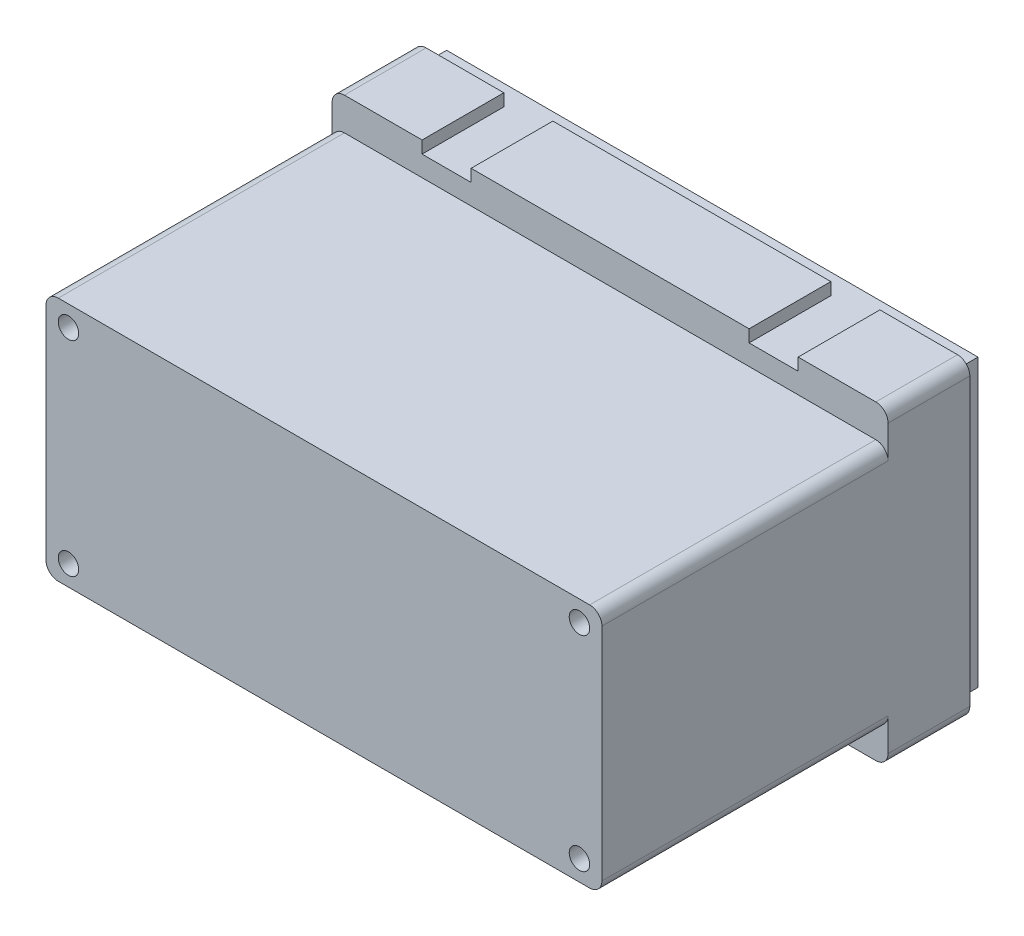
ISO-10303-21;
HEADER;
FILE_DESCRIPTION(('STEP AP214'),'2;1');
FILE_NAME('part.step','',(''),(''),'','','');
FILE_SCHEMA(('AUTOMOTIVE_DESIGN { 1 0 10303 214 1 1 1 1 }'));
ENDSEC;
DATA;
#1=APPLICATION_CONTEXT('core data for automotive mechanical design processes');
#2=APPLICATION_PROTOCOL_DEFINITION('international standard','automotive_design',2000,#1);
#3=PRODUCT_CONTEXT('',#1,'mechanical');
#4=PRODUCT('Part','Part','',(#3));
#5=PRODUCT_RELATED_PRODUCT_CATEGORY('part','',(#4));
#6=PRODUCT_DEFINITION_FORMATION('','',#4);
#7=PRODUCT_DEFINITION_CONTEXT('part definition',#1,'design');
#8=PRODUCT_DEFINITION('design','',#6,#7);
#9=PRODUCT_DEFINITION_SHAPE('','',#8);
#10=(LENGTH_UNIT() NAMED_UNIT(*) SI_UNIT(.MILLI.,.METRE.));
#11=(NAMED_UNIT(*) PLANE_ANGLE_UNIT() SI_UNIT($,.RADIAN.));
#12=(NAMED_UNIT(*) SI_UNIT($,.STERADIAN.) SOLID_ANGLE_UNIT());
#13=UNCERTAINTY_MEASURE_WITH_UNIT(LENGTH_MEASURE(1.E-05),#10,'distance_accuracy_value','');
#14=(GEOMETRIC_REPRESENTATION_CONTEXT(3) GLOBAL_UNCERTAINTY_ASSIGNED_CONTEXT((#13)) GLOBAL_UNIT_ASSIGNED_CONTEXT((#10,
#11,#12)) REPRESENTATION_CONTEXT('',''));
#15=CARTESIAN_POINT('',(0.,0.,0.));
#16=DIRECTION('',(0.,0.,1.));
#17=DIRECTION('',(1.,0.,0.));
#18=AXIS2_PLACEMENT_3D('',#15,#16,#17);
#19=CARTESIAN_POINT('',(65.,34.9999999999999,20.));
#20=DIRECTION('',(0.,0.,1.));
#21=DIRECTION('',(1.,0.,0.));
#22=AXIS2_PLACEMENT_3D('',#19,#20,#21);
#23=PLANE('',#22);
#24=CARTESIAN_POINT('',(65.,-26.9999999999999,20.));
#25=DIRECTION('',(0.,0.,1.));
#26=DIRECTION('',(-1.,0.,0.));
#27=AXIS2_PLACEMENT_3D('',#24,#25,#26);
#28=CIRCLE('',#27,3.);
#29=CARTESIAN_POINT('',(65.,-30.,20.));
#30=VERTEX_POINT('',#29);
#31=CARTESIAN_POINT('',(68.,-26.9999999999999,20.));
#32=VERTEX_POINT('',#31);
#33=EDGE_CURVE('E365',#30,#32,#28,.T.);
#34=ORIENTED_EDGE('',*,*,#33,.F.);
#35=DIRECTION('',(1.,0.,0.));
#36=VECTOR('',#35,1.);
#37=CARTESIAN_POINT('',(-65.,-30.,20.));
#38=LINE('',#37,#36);
#39=CARTESIAN_POINT('',(-65.,-30.,20.));
#40=VERTEX_POINT('',#39);
#41=EDGE_CURVE('E369',#40,#30,#38,.T.);
#42=ORIENTED_EDGE('',*,*,#41,.F.);
#43=CARTESIAN_POINT('',(-64.9999999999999,-26.9999999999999,20.));
#44=DIRECTION('',(0.,0.,1.));
#45=DIRECTION('',(-1.,0.,0.));
#46=AXIS2_PLACEMENT_3D('',#43,#44,#45);
#47=CIRCLE('',#46,3.);
#48=CARTESIAN_POINT('',(-67.9999999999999,-26.9999999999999,20.));
#49=VERTEX_POINT('',#48);
#50=EDGE_CURVE('E634',#49,#40,#47,.T.);
#51=ORIENTED_EDGE('',*,*,#50,.F.);
#52=DIRECTION('',(0.,-1.,0.));
#53=VECTOR('',#52,1.);
#54=CARTESIAN_POINT('',(-67.9999999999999,34.9999999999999,20.));
#55=LINE('',#54,#53);
#56=CARTESIAN_POINT('',(-68.,-34.9999999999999,20.));
#57=VERTEX_POINT('',#56);
#58=EDGE_CURVE('E843',#49,#57,#55,.T.);
#59=ORIENTED_EDGE('',*,*,#58,.T.);
#60=CARTESIAN_POINT('',(-65.,-34.9999999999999,20.));
#61=DIRECTION('',(0.,0.,1.));
#62=DIRECTION('',(-1.,0.,0.));
#63=AXIS2_PLACEMENT_3D('',#60,#61,#62);
#64=CIRCLE('',#63,2.99999999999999);
#65=CARTESIAN_POINT('',(-65.,-38.,20.));
#66=VERTEX_POINT('',#65);
#67=EDGE_CURVE('E846',#57,#66,#64,.T.);
#68=ORIENTED_EDGE('',*,*,#67,.T.);
#69=DIRECTION('',(1.,0.,0.));
#70=VECTOR('',#69,1.);
#71=CARTESIAN_POINT('',(-65.,-38.,20.));
#72=LINE('',#71,#70);
#73=CARTESIAN_POINT('',(-46.,-38.,20.));
#74=VERTEX_POINT('',#73);
#75=EDGE_CURVE('E944',#66,#74,#72,.T.);
#76=ORIENTED_EDGE('',*,*,#75,.T.);
#77=DIRECTION('',(0.,-1.,0.));
#78=VECTOR('',#77,1.);
#79=CARTESIAN_POINT('',(-46.,-34.9999999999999,20.));
#80=LINE('',#79,#78);
#81=CARTESIAN_POINT('',(-46.,-34.9999999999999,20.));
#82=VERTEX_POINT('',#81);
#83=EDGE_CURVE('E701',#82,#74,#80,.T.);
#84=ORIENTED_EDGE('',*,*,#83,.F.);
#85=DIRECTION('',(1.,0.,0.));
#86=VECTOR('',#85,1.);
#87=CARTESIAN_POINT('',(65.,-34.9999999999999,20.));
#88=LINE('',#87,#86);
#89=CARTESIAN_POINT('',(-34.,-34.9999999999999,20.));
#90=VERTEX_POINT('',#89);
#91=EDGE_CURVE('E11',#82,#90,#88,.T.);
#92=ORIENTED_EDGE('',*,*,#91,.T.);
#93=DIRECTION('',(0.,-1.,0.));
#94=VECTOR('',#93,1.);
#95=CARTESIAN_POINT('',(-34.,-34.9999999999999,20.));
#96=LINE('',#95,#94);
#97=CARTESIAN_POINT('',(-34.,-38.,20.));
#98=VERTEX_POINT('',#97);
#99=EDGE_CURVE('E702',#90,#98,#96,.T.);
#100=ORIENTED_EDGE('',*,*,#99,.T.);
#101=CARTESIAN_POINT('',(34.,-38.,20.));
#102=VERTEX_POINT('',#101);
#103=EDGE_CURVE('E943',#98,#102,#72,.T.);
#104=ORIENTED_EDGE('',*,*,#103,.T.);
#105=DIRECTION('',(0.,-1.,0.));
#106=VECTOR('',#105,1.);
#107=CARTESIAN_POINT('',(34.,-34.9999999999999,20.));
#108=LINE('',#107,#106);
#109=CARTESIAN_POINT('',(34.,-34.9999999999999,20.));
#110=VERTEX_POINT('',#109);
#111=EDGE_CURVE('E722',#110,#102,#108,.T.);
#112=ORIENTED_EDGE('',*,*,#111,.F.);
#113=DIRECTION('',(1.,0.,0.));
#114=VECTOR('',#113,1.);
#115=CARTESIAN_POINT('',(65.,-34.9999999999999,20.));
#116=LINE('',#115,#114);
#117=CARTESIAN_POINT('',(46.,-34.9999999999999,20.));
#118=VERTEX_POINT('',#117);
#119=EDGE_CURVE('E357',#110,#118,#116,.T.);
#120=ORIENTED_EDGE('',*,*,#119,.T.);
#121=DIRECTION('',(0.,-1.,0.));
#122=VECTOR('',#121,1.);
#123=CARTESIAN_POINT('',(46.,-34.9999999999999,20.));
#124=LINE('',#123,#122);
#125=CARTESIAN_POINT('',(46.,-38.,20.));
#126=VERTEX_POINT('',#125);
#127=EDGE_CURVE('E723',#118,#126,#124,.T.);
#128=ORIENTED_EDGE('',*,*,#127,.T.);
#129=CARTESIAN_POINT('',(65.,-38.,20.));
#130=VERTEX_POINT('',#129);
#131=EDGE_CURVE('E941',#126,#130,#72,.T.);
#132=ORIENTED_EDGE('',*,*,#131,.T.);
#133=CARTESIAN_POINT('',(65.,-34.9999999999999,20.));
#134=DIRECTION('',(0.,0.,1.));
#135=DIRECTION('',(-1.,0.,0.));
#136=AXIS2_PLACEMENT_3D('',#133,#134,#135);
#137=CIRCLE('',#136,2.99999999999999);
#138=CARTESIAN_POINT('',(68.,-34.9999999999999,20.));
#139=VERTEX_POINT('',#138);
#140=EDGE_CURVE('E858',#130,#139,#137,.T.);
#141=ORIENTED_EDGE('',*,*,#140,.T.);
#142=DIRECTION('',(0.,1.,0.));
#143=VECTOR('',#142,1.);
#144=CARTESIAN_POINT('',(68.,34.9999999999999,20.));
#145=LINE('',#144,#143);
#146=EDGE_CURVE('E857',#139,#32,#145,.T.);
#147=ORIENTED_EDGE('',*,*,#146,.T.);
#148=EDGE_LOOP('',(#34,#42,#51,#59,#68,#76,#84,#92,#100,#104,#112,#120,#128,#132,#141,#147));
#149=FACE_BOUND('',#148,.T.);
#150=ADVANCED_FACE('F348',(#149),#23,.T.);
#151=CARTESIAN_POINT('',(65.,34.9999999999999,0.));
#152=DIRECTION('',(0.,0.,1.));
#153=DIRECTION('',(1.,0.,0.));
#154=AXIS2_PLACEMENT_3D('',#151,#152,#153);
#155=PLANE('',#154);
#156=DIRECTION('',(1.,0.,0.));
#157=VECTOR('',#156,1.);
#158=CARTESIAN_POINT('',(-65.,-38.,0.));
#159=LINE('',#158,#157);
#160=CARTESIAN_POINT('',(-34.,-38.,0.));
#161=VERTEX_POINT('',#160);
#162=CARTESIAN_POINT('',(34.,-38.,0.));
#163=VERTEX_POINT('',#162);
#164=EDGE_CURVE('E829',#161,#163,#159,.T.);
#165=ORIENTED_EDGE('',*,*,#164,.F.);
#166=DIRECTION('',(0.,-1.,0.));
#167=VECTOR('',#166,1.);
#168=CARTESIAN_POINT('',(-34.,-34.9999999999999,0.));
#169=LINE('',#168,#167);
#170=CARTESIAN_POINT('',(-34.,-34.9999999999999,0.));
#171=VERTEX_POINT('',#170);
#172=EDGE_CURVE('E706',#171,#161,#169,.T.);
#173=ORIENTED_EDGE('',*,*,#172,.F.);
#174=DIRECTION('',(-1.,0.,0.));
#175=VECTOR('',#174,1.);
#176=CARTESIAN_POINT('',(64.9999999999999,-34.9999999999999,0.));
#177=LINE('',#176,#175);
#178=CARTESIAN_POINT('',(34.,-34.9999999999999,0.));
#179=VERTEX_POINT('',#178);
#180=EDGE_CURVE('E781',#179,#171,#177,.T.);
#181=ORIENTED_EDGE('',*,*,#180,.F.);
#182=DIRECTION('',(0.,-1.,0.));
#183=VECTOR('',#182,1.);
#184=CARTESIAN_POINT('',(34.,-34.9999999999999,0.));
#185=LINE('',#184,#183);
#186=EDGE_CURVE('E729',#179,#163,#185,.T.);
#187=ORIENTED_EDGE('',*,*,#186,.T.);
#188=EDGE_LOOP('',(#165,#173,#181,#187));
#189=FACE_BOUND('',#188,.T.);
#190=ADVANCED_FACE('F908',(#189),#155,.F.);
#191=CARTESIAN_POINT('',(-65.,-38.,20.));
#192=DIRECTION('',(0.,1.,0.));
#193=DIRECTION('',(-1.,0.,0.));
#194=AXIS2_PLACEMENT_3D('',#191,#192,#193);
#195=PLANE('',#194);
#196=ORIENTED_EDGE('',*,*,#103,.F.);
#197=DIRECTION('',(0.,0.,1.));
#198=VECTOR('',#197,1.);
#199=CARTESIAN_POINT('',(-34.,-38.,20.));
#200=LINE('',#199,#198);
#201=EDGE_CURVE('E694',#161,#98,#200,.T.);
#202=ORIENTED_EDGE('',*,*,#201,.F.);
#203=ORIENTED_EDGE('',*,*,#164,.T.);
#204=DIRECTION('',(0.,0.,1.));
#205=VECTOR('',#204,1.);
#206=CARTESIAN_POINT('',(34.,-38.,20.));
#207=LINE('',#206,#205);
#208=EDGE_CURVE('E705',#163,#102,#207,.T.);
#209=ORIENTED_EDGE('',*,*,#208,.T.);
#210=EDGE_LOOP('',(#196,#202,#203,#209));
#211=FACE_BOUND('',#210,.T.);
#212=ADVANCED_FACE('F1031',(#211),#195,.F.);
#213=DIRECTION('',(0.,-1.,0.));
#214=VECTOR('',#213,1.);
#215=CARTESIAN_POINT('',(46.,-34.9999999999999,0.));
#216=LINE('',#215,#214);
#217=CARTESIAN_POINT('',(46.,-34.9999999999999,0.));
#218=VERTEX_POINT('',#217);
#219=CARTESIAN_POINT('',(46.,-38.,0.));
#220=VERTEX_POINT('',#219);
#221=EDGE_CURVE('E727',#218,#220,#216,.T.);
#222=ORIENTED_EDGE('',*,*,#221,.F.);
#223=CARTESIAN_POINT('',(64.9999999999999,-34.9999999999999,0.));
#224=VERTEX_POINT('',#223);
#225=EDGE_CURVE('E777',#224,#218,#177,.T.);
#226=ORIENTED_EDGE('',*,*,#225,.F.);
#227=DIRECTION('',(0.,-1.,0.));
#228=VECTOR('',#227,1.);
#229=CARTESIAN_POINT('',(65.,34.9999999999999,0.));
#230=LINE('',#229,#228);
#231=CARTESIAN_POINT('',(65.,34.9999999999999,0.));
#232=VERTEX_POINT('',#231);
#233=EDGE_CURVE('E767',#232,#224,#230,.T.);
#234=ORIENTED_EDGE('',*,*,#233,.F.);
#235=DIRECTION('',(1.,0.,0.));
#236=VECTOR('',#235,1.);
#237=CARTESIAN_POINT('',(65.,34.9999999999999,0.));
#238=LINE('',#237,#236);
#239=CARTESIAN_POINT('',(46.,34.9999999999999,0.));
#240=VERTEX_POINT('',#239);
#241=EDGE_CURVE('E784',#240,#232,#238,.T.);
#242=ORIENTED_EDGE('',*,*,#241,.F.);
#243=DIRECTION('',(0.,1.,0.));
#244=VECTOR('',#243,1.);
#245=CARTESIAN_POINT('',(46.,34.9999999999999,0.));
#246=LINE('',#245,#244);
#247=CARTESIAN_POINT('',(46.,38.,0.));
#248=VERTEX_POINT('',#247);
#249=EDGE_CURVE('E770',#240,#248,#246,.T.);
#250=ORIENTED_EDGE('',*,*,#249,.T.);
#251=DIRECTION('',(-1.,0.,0.));
#252=VECTOR('',#251,1.);
#253=CARTESIAN_POINT('',(-65.,38.,0.));
#254=LINE('',#253,#252);
#255=CARTESIAN_POINT('',(65.,38.,0.));
#256=VERTEX_POINT('',#255);
#257=EDGE_CURVE('E814',#256,#248,#254,.T.);
#258=ORIENTED_EDGE('',*,*,#257,.F.);
#259=CARTESIAN_POINT('',(65.,34.9999999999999,0.));
#260=DIRECTION('',(0.,0.,1.));
#261=DIRECTION('',(1.,0.,0.));
#262=AXIS2_PLACEMENT_3D('',#259,#260,#261);
#263=CIRCLE('',#262,3.);
#264=CARTESIAN_POINT('',(68.,34.9999999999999,0.));
#265=VERTEX_POINT('',#264);
#266=EDGE_CURVE('E810',#265,#256,#263,.T.);
#267=ORIENTED_EDGE('',*,*,#266,.F.);
#268=DIRECTION('',(0.,1.,0.));
#269=VECTOR('',#268,1.);
#270=CARTESIAN_POINT('',(68.,34.9999999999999,0.));
#271=LINE('',#270,#269);
#272=CARTESIAN_POINT('',(68.,-34.9999999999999,0.));
#273=VERTEX_POINT('',#272);
#274=EDGE_CURVE('E831',#273,#265,#271,.T.);
#275=ORIENTED_EDGE('',*,*,#274,.F.);
#276=CARTESIAN_POINT('',(65.,-34.9999999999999,0.));
#277=DIRECTION('',(0.,0.,1.));
#278=DIRECTION('',(-1.,0.,0.));
#279=AXIS2_PLACEMENT_3D('',#276,#277,#278);
#280=CIRCLE('',#279,2.99999999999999);
#281=CARTESIAN_POINT('',(65.,-38.,0.));
#282=VERTEX_POINT('',#281);
#283=EDGE_CURVE('E828',#282,#273,#280,.T.);
#284=ORIENTED_EDGE('',*,*,#283,.F.);
#285=EDGE_CURVE('E824',#220,#282,#159,.T.);
#286=ORIENTED_EDGE('',*,*,#285,.F.);
#287=EDGE_LOOP('',(#222,#226,#234,#242,#250,#258,#267,#275,#284,#286));
#288=FACE_BOUND('',#287,.T.);
#289=ADVANCED_FACE('F933',(#288),#155,.F.);
#290=CARTESIAN_POINT('',(-46.,-34.9999999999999,0.));
#291=VERTEX_POINT('',#290);
#292=CARTESIAN_POINT('',(-65.,-34.9999999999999,0.));
#293=VERTEX_POINT('',#292);
#294=EDGE_CURVE('E776',#291,#293,#177,.T.);
#295=ORIENTED_EDGE('',*,*,#294,.F.);
#296=DIRECTION('',(0.,-1.,0.));
#297=VECTOR('',#296,1.);
#298=CARTESIAN_POINT('',(-46.,-34.9999999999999,0.));
#299=LINE('',#298,#297);
#300=CARTESIAN_POINT('',(-46.,-38.,0.));
#301=VERTEX_POINT('',#300);
#302=EDGE_CURVE('E708',#291,#301,#299,.T.);
#303=ORIENTED_EDGE('',*,*,#302,.T.);
#304=CARTESIAN_POINT('',(-65.,-38.,0.));
#305=VERTEX_POINT('',#304);
#306=EDGE_CURVE('E825',#305,#301,#159,.T.);
#307=ORIENTED_EDGE('',*,*,#306,.F.);
#308=CARTESIAN_POINT('',(-65.,-34.9999999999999,0.));
#309=DIRECTION('',(0.,0.,1.));
#310=DIRECTION('',(-1.,0.,0.));
#311=AXIS2_PLACEMENT_3D('',#308,#309,#310);
#312=CIRCLE('',#311,2.99999999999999);
#313=CARTESIAN_POINT('',(-68.,-34.9999999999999,0.));
#314=VERTEX_POINT('',#313);
#315=EDGE_CURVE('E822',#314,#305,#312,.T.);
#316=ORIENTED_EDGE('',*,*,#315,.F.);
#317=DIRECTION('',(0.,-1.,0.));
#318=VECTOR('',#317,1.);
#319=CARTESIAN_POINT('',(-67.9999999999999,34.9999999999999,0.));
#320=LINE('',#319,#318);
#321=CARTESIAN_POINT('',(-67.9999999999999,34.9999999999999,0.));
#322=VERTEX_POINT('',#321);
#323=EDGE_CURVE('E820',#322,#314,#320,.T.);
#324=ORIENTED_EDGE('',*,*,#323,.F.);
#325=CARTESIAN_POINT('',(-65.,34.9999999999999,0.));
#326=DIRECTION('',(0.,0.,1.));
#327=DIRECTION('',(-1.,0.,0.));
#328=AXIS2_PLACEMENT_3D('',#325,#326,#327);
#329=CIRCLE('',#328,3.);
#330=CARTESIAN_POINT('',(-65.,38.,0.));
#331=VERTEX_POINT('',#330);
#332=EDGE_CURVE('E817',#331,#322,#329,.T.);
#333=ORIENTED_EDGE('',*,*,#332,.F.);
#334=CARTESIAN_POINT('',(-46.,38.,0.));
#335=VERTEX_POINT('',#334);
#336=EDGE_CURVE('E813',#335,#331,#254,.T.);
#337=ORIENTED_EDGE('',*,*,#336,.F.);
#338=DIRECTION('',(0.,1.,0.));
#339=VECTOR('',#338,1.);
#340=CARTESIAN_POINT('',(-46.,34.9999999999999,0.));
#341=LINE('',#340,#339);
#342=CARTESIAN_POINT('',(-46.,34.9999999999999,0.));
#343=VERTEX_POINT('',#342);
#344=EDGE_CURVE('E749',#343,#335,#341,.T.);
#345=ORIENTED_EDGE('',*,*,#344,.F.);
#346=CARTESIAN_POINT('',(-64.9999999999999,34.9999999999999,0.));
#347=VERTEX_POINT('',#346);
#348=EDGE_CURVE('E785',#347,#343,#238,.T.);
#349=ORIENTED_EDGE('',*,*,#348,.F.);
#350=DIRECTION('',(0.,1.,0.));
#351=VECTOR('',#350,1.);
#352=CARTESIAN_POINT('',(-64.9999999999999,34.9999999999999,0.));
#353=LINE('',#352,#351);
#354=EDGE_CURVE('E780',#293,#347,#353,.T.);
#355=ORIENTED_EDGE('',*,*,#354,.F.);
#356=EDGE_LOOP('',(#295,#303,#307,#316,#324,#333,#337,#345,#349,#355));
#357=FACE_BOUND('',#356,.T.);
#358=ADVANCED_FACE('F916',(#357),#155,.F.);
#359=CARTESIAN_POINT('',(64.9999999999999,26.9999999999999,20.));
#360=DIRECTION('',(0.,0.,1.));
#361=DIRECTION('',(1.,0.,0.));
#362=AXIS2_PLACEMENT_3D('',#359,#360,#361);
#363=CIRCLE('',#362,3.);
#364=CARTESIAN_POINT('',(67.9999999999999,26.9999999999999,20.));
#365=VERTEX_POINT('',#364);
#366=CARTESIAN_POINT('',(65.,30.,20.));
#367=VERTEX_POINT('',#366);
#368=EDGE_CURVE('E623',#365,#367,#363,.T.);
#369=ORIENTED_EDGE('',*,*,#368,.F.);
#370=CARTESIAN_POINT('',(68.,34.9999999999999,20.));
#371=VERTEX_POINT('',#370);
#372=EDGE_CURVE('E854',#365,#371,#145,.T.);
#373=ORIENTED_EDGE('',*,*,#372,.T.);
#374=CARTESIAN_POINT('',(65.,34.9999999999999,20.));
#375=DIRECTION('',(0.,0.,1.));
#376=DIRECTION('',(1.,0.,0.));
#377=AXIS2_PLACEMENT_3D('',#374,#375,#376);
#378=CIRCLE('',#377,3.);
#379=CARTESIAN_POINT('',(65.,38.,20.));
#380=VERTEX_POINT('',#379);
#381=EDGE_CURVE('E833',#371,#380,#378,.T.);
#382=ORIENTED_EDGE('',*,*,#381,.T.);
#383=DIRECTION('',(-1.,0.,0.));
#384=VECTOR('',#383,1.);
#385=CARTESIAN_POINT('',(-65.,38.,20.));
#386=LINE('',#385,#384);
#387=CARTESIAN_POINT('',(46.,38.,20.));
#388=VERTEX_POINT('',#387);
#389=EDGE_CURVE('E837',#380,#388,#386,.T.);
#390=ORIENTED_EDGE('',*,*,#389,.T.);
#391=DIRECTION('',(0.,1.,0.));
#392=VECTOR('',#391,1.);
#393=CARTESIAN_POINT('',(46.,34.9999999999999,20.));
#394=LINE('',#393,#392);
#395=CARTESIAN_POINT('',(46.,34.9999999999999,20.));
#396=VERTEX_POINT('',#395);
#397=EDGE_CURVE('E763',#396,#388,#394,.T.);
#398=ORIENTED_EDGE('',*,*,#397,.F.);
#399=DIRECTION('',(-1.,0.,0.));
#400=VECTOR('',#399,1.);
#401=CARTESIAN_POINT('',(65.,34.9999999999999,20.));
#402=LINE('',#401,#400);
#403=CARTESIAN_POINT('',(34.,34.9999999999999,20.));
#404=VERTEX_POINT('',#403);
#405=EDGE_CURVE('E887',#396,#404,#402,.T.);
#406=ORIENTED_EDGE('',*,*,#405,.T.);
#407=DIRECTION('',(0.,1.,0.));
#408=VECTOR('',#407,1.);
#409=CARTESIAN_POINT('',(34.,34.9999999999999,20.));
#410=LINE('',#409,#408);
#411=CARTESIAN_POINT('',(34.,38.,20.));
#412=VERTEX_POINT('',#411);
#413=EDGE_CURVE('E764',#404,#412,#410,.T.);
#414=ORIENTED_EDGE('',*,*,#413,.T.);
#415=CARTESIAN_POINT('',(-34.,38.,20.));
#416=VERTEX_POINT('',#415);
#417=EDGE_CURVE('E841',#412,#416,#386,.T.);
#418=ORIENTED_EDGE('',*,*,#417,.T.);
#419=DIRECTION('',(0.,1.,0.));
#420=VECTOR('',#419,1.);
#421=CARTESIAN_POINT('',(-34.,34.9999999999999,20.));
#422=LINE('',#421,#420);
#423=CARTESIAN_POINT('',(-34.,34.9999999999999,20.));
#424=VERTEX_POINT('',#423);
#425=EDGE_CURVE('E744',#424,#416,#422,.T.);
#426=ORIENTED_EDGE('',*,*,#425,.F.);
#427=DIRECTION('',(-1.,0.,0.));
#428=VECTOR('',#427,1.);
#429=CARTESIAN_POINT('',(65.,34.9999999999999,20.));
#430=LINE('',#429,#428);
#431=CARTESIAN_POINT('',(-46.,34.9999999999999,20.));
#432=VERTEX_POINT('',#431);
#433=EDGE_CURVE('E890',#424,#432,#430,.T.);
#434=ORIENTED_EDGE('',*,*,#433,.T.);
#435=DIRECTION('',(0.,1.,0.));
#436=VECTOR('',#435,1.);
#437=CARTESIAN_POINT('',(-46.,34.9999999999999,20.));
#438=LINE('',#437,#436);
#439=CARTESIAN_POINT('',(-46.,38.,20.));
#440=VERTEX_POINT('',#439);
#441=EDGE_CURVE('E745',#432,#440,#438,.T.);
#442=ORIENTED_EDGE('',*,*,#441,.T.);
#443=CARTESIAN_POINT('',(-65.,38.,20.));
#444=VERTEX_POINT('',#443);
#445=EDGE_CURVE('E836',#440,#444,#386,.T.);
#446=ORIENTED_EDGE('',*,*,#445,.T.);
#447=CARTESIAN_POINT('',(-65.,34.9999999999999,20.));
#448=DIRECTION('',(0.,0.,1.));
#449=DIRECTION('',(-1.,0.,0.));
#450=AXIS2_PLACEMENT_3D('',#447,#448,#449);
#451=CIRCLE('',#450,3.);
#452=CARTESIAN_POINT('',(-67.9999999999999,34.9999999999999,20.));
#453=VERTEX_POINT('',#452);
#454=EDGE_CURVE('E840',#444,#453,#451,.T.);
#455=ORIENTED_EDGE('',*,*,#454,.T.);
#456=CARTESIAN_POINT('',(-68.,26.9999999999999,20.));
#457=VERTEX_POINT('',#456);
#458=EDGE_CURVE('E852',#453,#457,#55,.T.);
#459=ORIENTED_EDGE('',*,*,#458,.T.);
#460=CARTESIAN_POINT('',(-65.,26.9999999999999,20.));
#461=DIRECTION('',(0.,0.,1.));
#462=DIRECTION('',(-1.,0.,0.));
#463=AXIS2_PLACEMENT_3D('',#460,#461,#462);
#464=CIRCLE('',#463,3.);
#465=CARTESIAN_POINT('',(-64.9999999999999,30.,20.));
#466=VERTEX_POINT('',#465);
#467=EDGE_CURVE('E627',#466,#457,#464,.T.);
#468=ORIENTED_EDGE('',*,*,#467,.F.);
#469=DIRECTION('',(-1.,0.,0.));
#470=VECTOR('',#469,1.);
#471=CARTESIAN_POINT('',(-64.9999999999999,30.,20.));
#472=LINE('',#471,#470);
#473=EDGE_CURVE('E624',#367,#466,#472,.T.);
#474=ORIENTED_EDGE('',*,*,#473,.F.);
#475=EDGE_LOOP('',(#369,#373,#382,#390,#398,#406,#414,#418,#426,#434,#442,#446,#455,#459,#468,#474));
#476=FACE_BOUND('',#475,.T.);
#477=ADVANCED_FACE('F990',(#476),#23,.T.);
#478=DIRECTION('',(0.,0.,-1.));
#479=VECTOR('',#478,1.);
#480=CARTESIAN_POINT('',(46.,-38.,20.));
#481=LINE('',#480,#479);
#482=EDGE_CURVE('E714',#126,#220,#481,.T.);
#483=ORIENTED_EDGE('',*,*,#482,.T.);
#484=ORIENTED_EDGE('',*,*,#285,.T.);
#485=DIRECTION('',(0.,0.,-1.));
#486=VECTOR('',#485,1.);
#487=CARTESIAN_POINT('',(65.,-38.,20.));
#488=LINE('',#487,#486);
#489=EDGE_CURVE('E869',#130,#282,#488,.T.);
#490=ORIENTED_EDGE('',*,*,#489,.F.);
#491=ORIENTED_EDGE('',*,*,#131,.F.);
#492=EDGE_LOOP('',(#483,#484,#490,#491));
#493=FACE_BOUND('',#492,.T.);
#494=ADVANCED_FACE('F939',(#493),#195,.F.);
#495=ORIENTED_EDGE('',*,*,#306,.T.);
#496=DIRECTION('',(0.,0.,-1.));
#497=VECTOR('',#496,1.);
#498=CARTESIAN_POINT('',(-46.,-38.,20.));
#499=LINE('',#498,#497);
#500=EDGE_CURVE('E692',#74,#301,#499,.T.);
#501=ORIENTED_EDGE('',*,*,#500,.F.);
#502=ORIENTED_EDGE('',*,*,#75,.F.);
#503=DIRECTION('',(0.,0.,-1.));
#504=VECTOR('',#503,1.);
#505=CARTESIAN_POINT('',(-65.,-38.,20.));
#506=LINE('',#505,#504);
#507=EDGE_CURVE('E872',#66,#305,#506,.T.);
#508=ORIENTED_EDGE('',*,*,#507,.T.);
#509=EDGE_LOOP('',(#495,#501,#502,#508));
#510=FACE_BOUND('',#509,.T.);
#511=ADVANCED_FACE('F979',(#510),#195,.F.);
#512=CARTESIAN_POINT('',(-65.,38.,20.));
#513=DIRECTION('',(0.,-1.,0.));
#514=DIRECTION('',(1.,0.,0.));
#515=AXIS2_PLACEMENT_3D('',#512,#513,#514);
#516=PLANE('',#515);
#517=DIRECTION('',(0.,0.,-1.));
#518=VECTOR('',#517,1.);
#519=CARTESIAN_POINT('',(-46.,38.,20.));
#520=LINE('',#519,#518);
#521=EDGE_CURVE('E736',#440,#335,#520,.T.);
#522=ORIENTED_EDGE('',*,*,#521,.T.);
#523=ORIENTED_EDGE('',*,*,#336,.T.);
#524=DIRECTION('',(0.,0.,-1.));
#525=VECTOR('',#524,1.);
#526=CARTESIAN_POINT('',(-65.,38.,20.));
#527=LINE('',#526,#525);
#528=EDGE_CURVE('E881',#444,#331,#527,.T.);
#529=ORIENTED_EDGE('',*,*,#528,.F.);
#530=ORIENTED_EDGE('',*,*,#445,.F.);
#531=EDGE_LOOP('',(#522,#523,#529,#530));
#532=FACE_BOUND('',#531,.T.);
#533=ADVANCED_FACE('F1057',(#532),#516,.F.);
#534=DIRECTION('',(0.,0.,1.));
#535=VECTOR('',#534,1.);
#536=CARTESIAN_POINT('',(-34.,38.,20.));
#537=LINE('',#536,#535);
#538=CARTESIAN_POINT('',(-34.,38.,0.));
#539=VERTEX_POINT('',#538);
#540=EDGE_CURVE('E726',#539,#416,#537,.T.);
#541=ORIENTED_EDGE('',*,*,#540,.T.);
#542=ORIENTED_EDGE('',*,*,#417,.F.);
#543=DIRECTION('',(0.,0.,1.));
#544=VECTOR('',#543,1.);
#545=CARTESIAN_POINT('',(34.,38.,20.));
#546=LINE('',#545,#544);
#547=CARTESIAN_POINT('',(34.,38.,0.));
#548=VERTEX_POINT('',#547);
#549=EDGE_CURVE('E756',#548,#412,#546,.T.);
#550=ORIENTED_EDGE('',*,*,#549,.F.);
#551=EDGE_CURVE('E818',#548,#539,#254,.T.);
#552=ORIENTED_EDGE('',*,*,#551,.T.);
#553=EDGE_LOOP('',(#541,#542,#550,#552));
#554=FACE_BOUND('',#553,.T.);
#555=ADVANCED_FACE('F1049',(#554),#516,.F.);
#556=DIRECTION('',(0.,1.,0.));
#557=VECTOR('',#556,1.);
#558=CARTESIAN_POINT('',(-34.,34.9999999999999,0.));
#559=LINE('',#558,#557);
#560=CARTESIAN_POINT('',(-34.,34.9999999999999,0.));
#561=VERTEX_POINT('',#560);
#562=EDGE_CURVE('E751',#561,#539,#559,.T.);
#563=ORIENTED_EDGE('',*,*,#562,.T.);
#564=ORIENTED_EDGE('',*,*,#551,.F.);
#565=DIRECTION('',(0.,1.,0.));
#566=VECTOR('',#565,1.);
#567=CARTESIAN_POINT('',(34.,34.9999999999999,0.));
#568=LINE('',#567,#566);
#569=CARTESIAN_POINT('',(34.,34.9999999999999,0.));
#570=VERTEX_POINT('',#569);
#571=EDGE_CURVE('E768',#570,#548,#568,.T.);
#572=ORIENTED_EDGE('',*,*,#571,.F.);
#573=EDGE_CURVE('E789',#561,#570,#238,.T.);
#574=ORIENTED_EDGE('',*,*,#573,.F.);
#575=EDGE_LOOP('',(#563,#564,#572,#574));
#576=FACE_BOUND('',#575,.T.);
#577=ADVANCED_FACE('F1042',(#576),#155,.F.);
#578=CARTESIAN_POINT('',(65.,34.9999999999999,20.));
#579=DIRECTION('',(0.,0.,-1.));
#580=DIRECTION('',(-1.,0.,0.));
#581=AXIS2_PLACEMENT_3D('',#578,#579,#580);
#582=CYLINDRICAL_SURFACE('',#581,3.);
#583=ORIENTED_EDGE('',*,*,#266,.T.);
#584=DIRECTION('',(0.,0.,-1.));
#585=VECTOR('',#584,1.);
#586=CARTESIAN_POINT('',(65.,38.,20.));
#587=LINE('',#586,#585);
#588=EDGE_CURVE('E884',#380,#256,#587,.T.);
#589=ORIENTED_EDGE('',*,*,#588,.F.);
#590=ORIENTED_EDGE('',*,*,#381,.F.);
#591=DIRECTION('',(0.,0.,-1.));
#592=VECTOR('',#591,1.);
#593=CARTESIAN_POINT('',(68.,34.9999999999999,20.));
#594=LINE('',#593,#592);
#595=EDGE_CURVE('E862',#371,#265,#594,.T.);
#596=ORIENTED_EDGE('',*,*,#595,.T.);
#597=EDGE_LOOP('',(#583,#589,#590,#596));
#598=FACE_BOUND('',#597,.T.);
#599=ADVANCED_FACE('F350',(#598),#582,.T.);
#600=ORIENTED_EDGE('',*,*,#257,.T.);
#601=DIRECTION('',(0.,0.,-1.));
#602=VECTOR('',#601,1.);
#603=CARTESIAN_POINT('',(46.,38.,20.));
#604=LINE('',#603,#602);
#605=EDGE_CURVE('E748',#388,#248,#604,.T.);
#606=ORIENTED_EDGE('',*,*,#605,.F.);
#607=ORIENTED_EDGE('',*,*,#389,.F.);
#608=ORIENTED_EDGE('',*,*,#588,.T.);
#609=EDGE_LOOP('',(#600,#606,#607,#608));
#610=FACE_BOUND('',#609,.T.);
#611=ADVANCED_FACE('F1054',(#610),#516,.F.);
#612=CARTESIAN_POINT('',(-65.,34.9999999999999,20.));
#613=DIRECTION('',(0.,0.,-1.));
#614=DIRECTION('',(-1.,0.,0.));
#615=AXIS2_PLACEMENT_3D('',#612,#613,#614);
#616=CYLINDRICAL_SURFACE('',#615,3.);
#617=ORIENTED_EDGE('',*,*,#332,.T.);
#618=DIRECTION('',(0.,0.,-1.));
#619=VECTOR('',#618,1.);
#620=CARTESIAN_POINT('',(-67.9999999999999,34.9999999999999,20.));
#621=LINE('',#620,#619);
#622=EDGE_CURVE('E878',#453,#322,#621,.T.);
#623=ORIENTED_EDGE('',*,*,#622,.F.);
#624=ORIENTED_EDGE('',*,*,#454,.F.);
#625=ORIENTED_EDGE('',*,*,#528,.T.);
#626=EDGE_LOOP('',(#617,#623,#624,#625));
#627=FACE_BOUND('',#626,.T.);
#628=ADVANCED_FACE('F986',(#627),#616,.T.);
#629=CARTESIAN_POINT('',(-67.9999999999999,34.9999999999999,20.));
#630=DIRECTION('',(1.,0.,0.));
#631=DIRECTION('',(0.,0.,-1.));
#632=AXIS2_PLACEMENT_3D('',#629,#630,#631);
#633=PLANE('',#632);
#634=ORIENTED_EDGE('',*,*,#323,.T.);
#635=DIRECTION('',(0.,0.,-1.));
#636=VECTOR('',#635,1.);
#637=CARTESIAN_POINT('',(-68.,-34.9999999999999,20.));
#638=LINE('',#637,#636);
#639=EDGE_CURVE('E875',#57,#314,#638,.T.);
#640=ORIENTED_EDGE('',*,*,#639,.F.);
#641=ORIENTED_EDGE('',*,*,#58,.F.);
#642=DIRECTION('',(0.,0.,-1.));
#643=VECTOR('',#642,1.);
#644=CARTESIAN_POINT('',(-68.,-26.9999999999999,90.0000000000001));
#645=LINE('',#644,#643);
#646=CARTESIAN_POINT('',(-68.,-26.9999999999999,90.0000000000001));
#647=VERTEX_POINT('',#646);
#648=EDGE_CURVE('E640',#647,#49,#645,.T.);
#649=ORIENTED_EDGE('',*,*,#648,.F.);
#650=DIRECTION('',(0.,-1.,0.));
#651=VECTOR('',#650,1.);
#652=CARTESIAN_POINT('',(-68.0000000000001,26.9999999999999,90.0000000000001));
#653=LINE('',#652,#651);
#654=CARTESIAN_POINT('',(-68.0000000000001,26.9999999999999,90.0000000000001));
#655=VERTEX_POINT('',#654);
#656=EDGE_CURVE('E678',#655,#647,#653,.T.);
#657=ORIENTED_EDGE('',*,*,#656,.F.);
#658=DIRECTION('',(0.,0.,-1.));
#659=VECTOR('',#658,1.);
#660=CARTESIAN_POINT('',(-68.0000000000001,26.9999999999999,90.0000000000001));
#661=LINE('',#660,#659);
#662=EDGE_CURVE('E637',#655,#457,#661,.T.);
#663=ORIENTED_EDGE('',*,*,#662,.T.);
#664=ORIENTED_EDGE('',*,*,#458,.F.);
#665=ORIENTED_EDGE('',*,*,#622,.T.);
#666=EDGE_LOOP('',(#634,#640,#641,#649,#657,#663,#664,#665));
#667=FACE_BOUND('',#666,.T.);
#668=ADVANCED_FACE('F969',(#667),#633,.F.);
#669=CARTESIAN_POINT('',(-65.,-34.9999999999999,20.));
#670=DIRECTION('',(0.,0.,-1.));
#671=DIRECTION('',(-1.,0.,0.));
#672=AXIS2_PLACEMENT_3D('',#669,#670,#671);
#673=CYLINDRICAL_SURFACE('',#672,2.99999999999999);
#674=ORIENTED_EDGE('',*,*,#315,.T.);
#675=ORIENTED_EDGE('',*,*,#507,.F.);
#676=ORIENTED_EDGE('',*,*,#67,.F.);
#677=ORIENTED_EDGE('',*,*,#639,.T.);
#678=EDGE_LOOP('',(#674,#675,#676,#677));
#679=FACE_BOUND('',#678,.T.);
#680=ADVANCED_FACE('F975',(#679),#673,.T.);
#681=CARTESIAN_POINT('',(65.,-34.9999999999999,20.));
#682=DIRECTION('',(0.,0.,-1.));
#683=DIRECTION('',(-1.,0.,0.));
#684=AXIS2_PLACEMENT_3D('',#681,#682,#683);
#685=CYLINDRICAL_SURFACE('',#684,2.99999999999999);
#686=ORIENTED_EDGE('',*,*,#283,.T.);
#687=DIRECTION('',(0.,0.,-1.));
#688=VECTOR('',#687,1.);
#689=CARTESIAN_POINT('',(68.,-34.9999999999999,20.));
#690=LINE('',#689,#688);
#691=EDGE_CURVE('E866',#139,#273,#690,.T.);
#692=ORIENTED_EDGE('',*,*,#691,.F.);
#693=ORIENTED_EDGE('',*,*,#140,.F.);
#694=ORIENTED_EDGE('',*,*,#489,.T.);
#695=EDGE_LOOP('',(#686,#692,#693,#694));
#696=FACE_BOUND('',#695,.T.);
#697=ADVANCED_FACE('F951',(#696),#685,.T.);
#698=CARTESIAN_POINT('',(68.,34.9999999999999,20.));
#699=DIRECTION('',(-1.,0.,0.));
#700=DIRECTION('',(0.,0.,1.));
#701=AXIS2_PLACEMENT_3D('',#698,#699,#700);
#702=PLANE('',#701);
#703=ORIENTED_EDGE('',*,*,#274,.T.);
#704=ORIENTED_EDGE('',*,*,#595,.F.);
#705=ORIENTED_EDGE('',*,*,#372,.F.);
#706=DIRECTION('',(0.,0.,-1.));
#707=VECTOR('',#706,1.);
#708=CARTESIAN_POINT('',(67.9999999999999,26.9999999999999,90.0000000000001));
#709=LINE('',#708,#707);
#710=CARTESIAN_POINT('',(67.9999999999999,26.9999999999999,90.0000000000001));
#711=VERTEX_POINT('',#710);
#712=EDGE_CURVE('E665',#711,#365,#709,.T.);
#713=ORIENTED_EDGE('',*,*,#712,.F.);
#714=DIRECTION('',(0.,1.,0.));
#715=VECTOR('',#714,1.);
#716=CARTESIAN_POINT('',(67.9999999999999,26.9999999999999,90.0000000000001));
#717=LINE('',#716,#715);
#718=CARTESIAN_POINT('',(68.,-26.9999999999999,90.0000000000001));
#719=VERTEX_POINT('',#718);
#720=EDGE_CURVE('E686',#719,#711,#717,.T.);
#721=ORIENTED_EDGE('',*,*,#720,.F.);
#722=DIRECTION('',(0.,0.,-1.));
#723=VECTOR('',#722,1.);
#724=CARTESIAN_POINT('',(68.,-26.9999999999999,90.0000000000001));
#725=LINE('',#724,#723);
#726=EDGE_CURVE('E662',#719,#32,#725,.T.);
#727=ORIENTED_EDGE('',*,*,#726,.T.);
#728=ORIENTED_EDGE('',*,*,#146,.F.);
#729=ORIENTED_EDGE('',*,*,#691,.T.);
#730=EDGE_LOOP('',(#703,#704,#705,#713,#721,#727,#728,#729));
#731=FACE_BOUND('',#730,.T.);
#732=ADVANCED_FACE('F954',(#731),#702,.F.);
#733=CARTESIAN_POINT('',(65.,34.9999999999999,-5.));
#734=DIRECTION('',(-1.,0.,0.));
#735=DIRECTION('',(0.,0.,1.));
#736=AXIS2_PLACEMENT_3D('',#733,#734,#735);
#737=PLANE('',#736);
#738=ORIENTED_EDGE('',*,*,#233,.T.);
#739=DIRECTION('',(0.,0.,1.));
#740=VECTOR('',#739,1.);
#741=CARTESIAN_POINT('',(64.9999999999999,-34.9999999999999,-5.));
#742=LINE('',#741,#740);
#743=CARTESIAN_POINT('',(64.9999999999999,-34.9999999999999,-5.));
#744=VERTEX_POINT('',#743);
#745=EDGE_CURVE('E807',#744,#224,#742,.T.);
#746=ORIENTED_EDGE('',*,*,#745,.F.);
#747=DIRECTION('',(0.,-1.,0.));
#748=VECTOR('',#747,1.);
#749=CARTESIAN_POINT('',(65.,34.9999999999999,-5.));
#750=LINE('',#749,#748);
#751=CARTESIAN_POINT('',(65.,34.9999999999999,-5.));
#752=VERTEX_POINT('',#751);
#753=EDGE_CURVE('E788',#752,#744,#750,.T.);
#754=ORIENTED_EDGE('',*,*,#753,.F.);
#755=DIRECTION('',(0.,0.,1.));
#756=VECTOR('',#755,1.);
#757=CARTESIAN_POINT('',(65.,34.9999999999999,-5.));
#758=LINE('',#757,#756);
#759=EDGE_CURVE('E798',#752,#232,#758,.T.);
#760=ORIENTED_EDGE('',*,*,#759,.T.);
#761=EDGE_LOOP('',(#738,#746,#754,#760));
#762=FACE_BOUND('',#761,.T.);
#763=ADVANCED_FACE('F929',(#762),#737,.F.);
#764=CARTESIAN_POINT('',(64.9999999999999,-34.9999999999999,-5.));
#765=DIRECTION('',(0.,1.,0.));
#766=DIRECTION('',(0.,0.,1.));
#767=AXIS2_PLACEMENT_3D('',#764,#765,#766);
#768=PLANE('',#767);
#769=ORIENTED_EDGE('',*,*,#225,.T.);
#770=DIRECTION('',(0.,0.,-1.));
#771=VECTOR('',#770,1.);
#772=CARTESIAN_POINT('',(46.,-34.9999999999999,20.));
#773=LINE('',#772,#771);
#774=EDGE_CURVE('E720',#118,#218,#773,.T.);
#775=ORIENTED_EDGE('',*,*,#774,.F.);
#776=ORIENTED_EDGE('',*,*,#119,.F.);
#777=DIRECTION('',(0.,0.,1.));
#778=VECTOR('',#777,1.);
#779=CARTESIAN_POINT('',(34.,-34.9999999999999,20.));
#780=LINE('',#779,#778);
#781=EDGE_CURVE('E717',#179,#110,#780,.T.);
#782=ORIENTED_EDGE('',*,*,#781,.F.);
#783=ORIENTED_EDGE('',*,*,#180,.T.);
#784=DIRECTION('',(0.,0.,1.));
#785=VECTOR('',#784,1.);
#786=CARTESIAN_POINT('',(-34.,-34.9999999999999,20.));
#787=LINE('',#786,#785);
#788=EDGE_CURVE('E698',#171,#90,#787,.T.);
#789=ORIENTED_EDGE('',*,*,#788,.T.);
#790=ORIENTED_EDGE('',*,*,#91,.F.);
#791=DIRECTION('',(0.,0.,-1.));
#792=VECTOR('',#791,1.);
#793=CARTESIAN_POINT('',(-46.,-34.9999999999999,20.));
#794=LINE('',#793,#792);
#795=EDGE_CURVE('E696',#82,#291,#794,.T.);
#796=ORIENTED_EDGE('',*,*,#795,.T.);
#797=ORIENTED_EDGE('',*,*,#294,.T.);
#798=DIRECTION('',(0.,0.,1.));
#799=VECTOR('',#798,1.);
#800=CARTESIAN_POINT('',(-65.,-34.9999999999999,-5.));
#801=LINE('',#800,#799);
#802=CARTESIAN_POINT('',(-65.,-34.9999999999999,-5.));
#803=VERTEX_POINT('',#802);
#804=EDGE_CURVE('E804',#803,#293,#801,.T.);
#805=ORIENTED_EDGE('',*,*,#804,.F.);
#806=DIRECTION('',(-1.,0.,0.));
#807=VECTOR('',#806,1.);
#808=CARTESIAN_POINT('',(64.9999999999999,-34.9999999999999,-5.));
#809=LINE('',#808,#807);
#810=EDGE_CURVE('E792',#744,#803,#809,.T.);
#811=ORIENTED_EDGE('',*,*,#810,.F.);
#812=ORIENTED_EDGE('',*,*,#745,.T.);
#813=EDGE_LOOP('',(#769,#775,#776,#782,#783,#789,#790,#796,#797,#805,#811,#812));
#814=FACE_BOUND('',#813,.T.);
#815=ADVANCED_FACE('F898',(#814),#768,.F.);
#816=CARTESIAN_POINT('',(-64.9999999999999,34.9999999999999,-5.));
#817=DIRECTION('',(1.,0.,0.));
#818=DIRECTION('',(0.,0.,-1.));
#819=AXIS2_PLACEMENT_3D('',#816,#817,#818);
#820=PLANE('',#819);
#821=ORIENTED_EDGE('',*,*,#354,.T.);
#822=DIRECTION('',(0.,0.,1.));
#823=VECTOR('',#822,1.);
#824=CARTESIAN_POINT('',(-64.9999999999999,34.9999999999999,-5.));
#825=LINE('',#824,#823);
#826=CARTESIAN_POINT('',(-64.9999999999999,34.9999999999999,-5.));
#827=VERTEX_POINT('',#826);
#828=EDGE_CURVE('E801',#827,#347,#825,.T.);
#829=ORIENTED_EDGE('',*,*,#828,.F.);
#830=DIRECTION('',(0.,1.,0.));
#831=VECTOR('',#830,1.);
#832=CARTESIAN_POINT('',(-64.9999999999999,34.9999999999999,-5.));
#833=LINE('',#832,#831);
#834=EDGE_CURVE('E794',#803,#827,#833,.T.);
#835=ORIENTED_EDGE('',*,*,#834,.F.);
#836=ORIENTED_EDGE('',*,*,#804,.T.);
#837=EDGE_LOOP('',(#821,#829,#835,#836));
#838=FACE_BOUND('',#837,.T.);
#839=ADVANCED_FACE('F920',(#838),#820,.F.);
#840=CARTESIAN_POINT('',(65.,34.9999999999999,-5.));
#841=DIRECTION('',(0.,-1.,0.));
#842=DIRECTION('',(0.,0.,-1.));
#843=AXIS2_PLACEMENT_3D('',#840,#841,#842);
#844=PLANE('',#843);
#845=ORIENTED_EDGE('',*,*,#348,.T.);
#846=DIRECTION('',(0.,0.,-1.));
#847=VECTOR('',#846,1.);
#848=CARTESIAN_POINT('',(-46.,34.9999999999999,20.));
#849=LINE('',#848,#847);
#850=EDGE_CURVE('E742',#432,#343,#849,.T.);
#851=ORIENTED_EDGE('',*,*,#850,.F.);
#852=ORIENTED_EDGE('',*,*,#433,.F.);
#853=DIRECTION('',(0.,0.,1.));
#854=VECTOR('',#853,1.);
#855=CARTESIAN_POINT('',(-34.,34.9999999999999,20.));
#856=LINE('',#855,#854);
#857=EDGE_CURVE('E739',#561,#424,#856,.T.);
#858=ORIENTED_EDGE('',*,*,#857,.F.);
#859=ORIENTED_EDGE('',*,*,#573,.T.);
#860=DIRECTION('',(0.,0.,1.));
#861=VECTOR('',#860,1.);
#862=CARTESIAN_POINT('',(34.,34.9999999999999,20.));
#863=LINE('',#862,#861);
#864=EDGE_CURVE('E760',#570,#404,#863,.T.);
#865=ORIENTED_EDGE('',*,*,#864,.T.);
#866=ORIENTED_EDGE('',*,*,#405,.F.);
#867=DIRECTION('',(0.,0.,-1.));
#868=VECTOR('',#867,1.);
#869=CARTESIAN_POINT('',(46.,34.9999999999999,20.));
#870=LINE('',#869,#868);
#871=EDGE_CURVE('E758',#396,#240,#870,.T.);
#872=ORIENTED_EDGE('',*,*,#871,.T.);
#873=ORIENTED_EDGE('',*,*,#241,.T.);
#874=ORIENTED_EDGE('',*,*,#759,.F.);
#875=DIRECTION('',(1.,0.,0.));
#876=VECTOR('',#875,1.);
#877=CARTESIAN_POINT('',(65.,34.9999999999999,-5.));
#878=LINE('',#877,#876);
#879=EDGE_CURVE('E796',#827,#752,#878,.T.);
#880=ORIENTED_EDGE('',*,*,#879,.F.);
#881=ORIENTED_EDGE('',*,*,#828,.T.);
#882=EDGE_LOOP('',(#845,#851,#852,#858,#859,#865,#866,#872,#873,#874,#880,#881));
#883=FACE_BOUND('',#882,.T.);
#884=ADVANCED_FACE('F1075',(#883),#844,.F.);
#885=CARTESIAN_POINT('',(64.9999999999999,-34.9999999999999,-5.));
#886=DIRECTION('',(0.,0.,-1.));
#887=DIRECTION('',(-1.,0.,0.));
#888=AXIS2_PLACEMENT_3D('',#885,#886,#887);
#889=PLANE('',#888);
#890=ORIENTED_EDGE('',*,*,#753,.T.);
#891=ORIENTED_EDGE('',*,*,#810,.T.);
#892=ORIENTED_EDGE('',*,*,#834,.T.);
#893=ORIENTED_EDGE('',*,*,#879,.T.);
#894=EDGE_LOOP('',(#890,#891,#892,#893));
#895=FACE_BOUND('',#894,.T.);
#896=ADVANCED_FACE('F923',(#895),#889,.T.);
#897=CARTESIAN_POINT('',(34.,34.9999999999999,20.));
#898=DIRECTION('',(-1.,0.,0.));
#899=DIRECTION('',(0.,-1.,0.));
#900=AXIS2_PLACEMENT_3D('',#897,#898,#899);
#901=PLANE('',#900);
#902=ORIENTED_EDGE('',*,*,#549,.T.);
#903=ORIENTED_EDGE('',*,*,#413,.F.);
#904=ORIENTED_EDGE('',*,*,#864,.F.);
#905=ORIENTED_EDGE('',*,*,#571,.T.);
#906=EDGE_LOOP('',(#902,#903,#904,#905));
#907=FACE_BOUND('',#906,.T.);
#908=ADVANCED_FACE('F1089',(#907),#901,.F.);
#909=CARTESIAN_POINT('',(46.,34.9999999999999,20.));
#910=DIRECTION('',(1.,0.,0.));
#911=DIRECTION('',(0.,1.,0.));
#912=AXIS2_PLACEMENT_3D('',#909,#910,#911);
#913=PLANE('',#912);
#914=ORIENTED_EDGE('',*,*,#605,.T.);
#915=ORIENTED_EDGE('',*,*,#249,.F.);
#916=ORIENTED_EDGE('',*,*,#871,.F.);
#917=ORIENTED_EDGE('',*,*,#397,.T.);
#918=EDGE_LOOP('',(#914,#915,#916,#917));
#919=FACE_BOUND('',#918,.T.);
#920=ADVANCED_FACE('F1085',(#919),#913,.F.);
#921=CARTESIAN_POINT('',(-46.,34.9999999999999,20.));
#922=DIRECTION('',(1.,0.,0.));
#923=DIRECTION('',(0.,1.,0.));
#924=AXIS2_PLACEMENT_3D('',#921,#922,#923);
#925=PLANE('',#924);
#926=ORIENTED_EDGE('',*,*,#521,.F.);
#927=ORIENTED_EDGE('',*,*,#441,.F.);
#928=ORIENTED_EDGE('',*,*,#850,.T.);
#929=ORIENTED_EDGE('',*,*,#344,.T.);
#930=EDGE_LOOP('',(#926,#927,#928,#929));
#931=FACE_BOUND('',#930,.T.);
#932=ADVANCED_FACE('F1072',(#931),#925,.T.);
#933=CARTESIAN_POINT('',(-34.,34.9999999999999,20.));
#934=DIRECTION('',(-1.,0.,0.));
#935=DIRECTION('',(0.,-1.,0.));
#936=AXIS2_PLACEMENT_3D('',#933,#934,#935);
#937=PLANE('',#936);
#938=ORIENTED_EDGE('',*,*,#540,.F.);
#939=ORIENTED_EDGE('',*,*,#562,.F.);
#940=ORIENTED_EDGE('',*,*,#857,.T.);
#941=ORIENTED_EDGE('',*,*,#425,.T.);
#942=EDGE_LOOP('',(#938,#939,#940,#941));
#943=FACE_BOUND('',#942,.T.);
#944=ADVANCED_FACE('F1076',(#943),#937,.T.);
#945=CARTESIAN_POINT('',(46.,-34.9999999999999,20.));
#946=DIRECTION('',(-1.,0.,0.));
#947=DIRECTION('',(0.,-1.,0.));
#948=AXIS2_PLACEMENT_3D('',#945,#946,#947);
#949=PLANE('',#948);
#950=ORIENTED_EDGE('',*,*,#482,.F.);
#951=ORIENTED_EDGE('',*,*,#127,.F.);
#952=ORIENTED_EDGE('',*,*,#774,.T.);
#953=ORIENTED_EDGE('',*,*,#221,.T.);
#954=EDGE_LOOP('',(#950,#951,#952,#953));
#955=FACE_BOUND('',#954,.T.);
#956=ADVANCED_FACE('F937',(#955),#949,.T.);
#957=CARTESIAN_POINT('',(34.,-34.9999999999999,20.));
#958=DIRECTION('',(1.,0.,0.));
#959=DIRECTION('',(0.,1.,0.));
#960=AXIS2_PLACEMENT_3D('',#957,#958,#959);
#961=PLANE('',#960);
#962=ORIENTED_EDGE('',*,*,#208,.F.);
#963=ORIENTED_EDGE('',*,*,#186,.F.);
#964=ORIENTED_EDGE('',*,*,#781,.T.);
#965=ORIENTED_EDGE('',*,*,#111,.T.);
#966=EDGE_LOOP('',(#962,#963,#964,#965));
#967=FACE_BOUND('',#966,.T.);
#968=ADVANCED_FACE('F903',(#967),#961,.T.);
#969=CARTESIAN_POINT('',(-34.,-34.9999999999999,20.));
#970=DIRECTION('',(1.,0.,0.));
#971=DIRECTION('',(0.,1.,0.));
#972=AXIS2_PLACEMENT_3D('',#969,#970,#971);
#973=PLANE('',#972);
#974=ORIENTED_EDGE('',*,*,#201,.T.);
#975=ORIENTED_EDGE('',*,*,#99,.F.);
#976=ORIENTED_EDGE('',*,*,#788,.F.);
#977=ORIENTED_EDGE('',*,*,#172,.T.);
#978=EDGE_LOOP('',(#974,#975,#976,#977));
#979=FACE_BOUND('',#978,.T.);
#980=ADVANCED_FACE('F1132',(#979),#973,.F.);
#981=CARTESIAN_POINT('',(-46.,-34.9999999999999,20.));
#982=DIRECTION('',(-1.,0.,0.));
#983=DIRECTION('',(0.,-1.,0.));
#984=AXIS2_PLACEMENT_3D('',#981,#982,#983);
#985=PLANE('',#984);
#986=ORIENTED_EDGE('',*,*,#500,.T.);
#987=ORIENTED_EDGE('',*,*,#302,.F.);
#988=ORIENTED_EDGE('',*,*,#795,.F.);
#989=ORIENTED_EDGE('',*,*,#83,.T.);
#990=EDGE_LOOP('',(#986,#987,#988,#989));
#991=FACE_BOUND('',#990,.T.);
#992=ADVANCED_FACE('F981',(#991),#985,.F.);
#993=CARTESIAN_POINT('',(64.9999999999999,26.9999999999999,90.0000000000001));
#994=DIRECTION('',(0.,0.,-1.));
#995=DIRECTION('',(-1.,0.,0.));
#996=AXIS2_PLACEMENT_3D('',#993,#994,#995);
#997=CYLINDRICAL_SURFACE('',#996,3.);
#998=ORIENTED_EDGE('',*,*,#368,.T.);
#999=DIRECTION('',(0.,0.,-1.));
#1000=VECTOR('',#999,1.);
#1001=CARTESIAN_POINT('',(65.,30.,90.0000000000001));
#1002=LINE('',#1001,#1000);
#1003=CARTESIAN_POINT('',(65.,30.,90.0000000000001));
#1004=VERTEX_POINT('',#1003);
#1005=EDGE_CURVE('E646',#1004,#367,#1002,.T.);
#1006=ORIENTED_EDGE('',*,*,#1005,.F.);
#1007=CARTESIAN_POINT('',(64.9999999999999,26.9999999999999,90.0000000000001));
#1008=DIRECTION('',(0.,0.,1.));
#1009=DIRECTION('',(1.,0.,0.));
#1010=AXIS2_PLACEMENT_3D('',#1007,#1008,#1009);
#1011=CIRCLE('',#1010,3.);
#1012=EDGE_CURVE('E667',#711,#1004,#1011,.T.);
#1013=ORIENTED_EDGE('',*,*,#1012,.F.);
#1014=ORIENTED_EDGE('',*,*,#712,.T.);
#1015=EDGE_LOOP('',(#998,#1006,#1013,#1014));
#1016=FACE_BOUND('',#1015,.T.);
#1017=ADVANCED_FACE('F1005',(#1016),#997,.T.);
#1018=CARTESIAN_POINT('',(-65.,30.,90.0000000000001));
#1019=DIRECTION('',(0.,-1.,0.));
#1020=DIRECTION('',(1.,0.,0.));
#1021=AXIS2_PLACEMENT_3D('',#1018,#1019,#1020);
#1022=PLANE('',#1021);
#1023=ORIENTED_EDGE('',*,*,#473,.T.);
#1024=DIRECTION('',(0.,0.,-1.));
#1025=VECTOR('',#1024,1.);
#1026=CARTESIAN_POINT('',(-65.,30.,90.0000000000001));
#1027=LINE('',#1026,#1025);
#1028=CARTESIAN_POINT('',(-65.,30.,90.0000000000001));
#1029=VERTEX_POINT('',#1028);
#1030=EDGE_CURVE('E639',#1029,#466,#1027,.T.);
#1031=ORIENTED_EDGE('',*,*,#1030,.F.);
#1032=DIRECTION('',(-1.,0.,0.));
#1033=VECTOR('',#1032,1.);
#1034=CARTESIAN_POINT('',(-65.,30.,90.0000000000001));
#1035=LINE('',#1034,#1033);
#1036=EDGE_CURVE('E674',#1004,#1029,#1035,.T.);
#1037=ORIENTED_EDGE('',*,*,#1036,.F.);
#1038=ORIENTED_EDGE('',*,*,#1005,.T.);
#1039=EDGE_LOOP('',(#1023,#1031,#1037,#1038));
#1040=FACE_BOUND('',#1039,.T.);
#1041=ADVANCED_FACE('F996',(#1040),#1022,.F.);
#1042=CARTESIAN_POINT('',(-65.0000000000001,26.9999999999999,90.0000000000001));
#1043=DIRECTION('',(0.,0.,-1.));
#1044=DIRECTION('',(-1.,0.,0.));
#1045=AXIS2_PLACEMENT_3D('',#1042,#1043,#1044);
#1046=CYLINDRICAL_SURFACE('',#1045,3.);
#1047=ORIENTED_EDGE('',*,*,#467,.T.);
#1048=ORIENTED_EDGE('',*,*,#662,.F.);
#1049=CARTESIAN_POINT('',(-65.0000000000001,26.9999999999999,90.0000000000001));
#1050=DIRECTION('',(0.,0.,1.));
#1051=DIRECTION('',(-1.,0.,0.));
#1052=AXIS2_PLACEMENT_3D('',#1049,#1050,#1051);
#1053=CIRCLE('',#1052,3.);
#1054=EDGE_CURVE('E676',#1029,#655,#1053,.T.);
#1055=ORIENTED_EDGE('',*,*,#1054,.F.);
#1056=ORIENTED_EDGE('',*,*,#1030,.T.);
#1057=EDGE_LOOP('',(#1047,#1048,#1055,#1056));
#1058=FACE_BOUND('',#1057,.T.);
#1059=ADVANCED_FACE('F992',(#1058),#1046,.T.);
#1060=CARTESIAN_POINT('',(-65.,-26.9999999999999,90.0000000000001));
#1061=DIRECTION('',(0.,0.,-1.));
#1062=DIRECTION('',(-1.,0.,0.));
#1063=AXIS2_PLACEMENT_3D('',#1060,#1061,#1062);
#1064=CYLINDRICAL_SURFACE('',#1063,3.);
#1065=ORIENTED_EDGE('',*,*,#50,.T.);
#1066=DIRECTION('',(0.,0.,-1.));
#1067=VECTOR('',#1066,1.);
#1068=CARTESIAN_POINT('',(-65.0000000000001,-30.,90.0000000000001));
#1069=LINE('',#1068,#1067);
#1070=CARTESIAN_POINT('',(-65.0000000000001,-30.,90.0000000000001));
#1071=VERTEX_POINT('',#1070);
#1072=EDGE_CURVE('E649',#1071,#40,#1069,.T.);
#1073=ORIENTED_EDGE('',*,*,#1072,.F.);
#1074=CARTESIAN_POINT('',(-65.,-26.9999999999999,90.0000000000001));
#1075=DIRECTION('',(0.,0.,1.));
#1076=DIRECTION('',(-1.,0.,0.));
#1077=AXIS2_PLACEMENT_3D('',#1074,#1075,#1076);
#1078=CIRCLE('',#1077,3.);
#1079=EDGE_CURVE('E680',#647,#1071,#1078,.T.);
#1080=ORIENTED_EDGE('',*,*,#1079,.F.);
#1081=ORIENTED_EDGE('',*,*,#648,.T.);
#1082=EDGE_LOOP('',(#1065,#1073,#1080,#1081));
#1083=FACE_BOUND('',#1082,.T.);
#1084=ADVANCED_FACE('F966',(#1083),#1064,.T.);
#1085=CARTESIAN_POINT('',(-65.0000000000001,-30.,90.0000000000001));
#1086=DIRECTION('',(0.,1.,0.));
#1087=DIRECTION('',(-1.,0.,0.));
#1088=AXIS2_PLACEMENT_3D('',#1085,#1086,#1087);
#1089=PLANE('',#1088);
#1090=ORIENTED_EDGE('',*,*,#41,.T.);
#1091=DIRECTION('',(0.,0.,-1.));
#1092=VECTOR('',#1091,1.);
#1093=CARTESIAN_POINT('',(65.,-30.,90.0000000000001));
#1094=LINE('',#1093,#1092);
#1095=CARTESIAN_POINT('',(65.,-30.,90.0000000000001));
#1096=VERTEX_POINT('',#1095);
#1097=EDGE_CURVE('E654',#1096,#30,#1094,.T.);
#1098=ORIENTED_EDGE('',*,*,#1097,.F.);
#1099=DIRECTION('',(1.,0.,0.));
#1100=VECTOR('',#1099,1.);
#1101=CARTESIAN_POINT('',(-65.0000000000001,-30.,90.0000000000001));
#1102=LINE('',#1101,#1100);
#1103=EDGE_CURVE('E682',#1071,#1096,#1102,.T.);
#1104=ORIENTED_EDGE('',*,*,#1103,.F.);
#1105=ORIENTED_EDGE('',*,*,#1072,.T.);
#1106=EDGE_LOOP('',(#1090,#1098,#1104,#1105));
#1107=FACE_BOUND('',#1106,.T.);
#1108=ADVANCED_FACE('F964',(#1107),#1089,.F.);
#1109=CARTESIAN_POINT('',(65.,-26.9999999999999,90.0000000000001));
#1110=DIRECTION('',(0.,0.,-1.));
#1111=DIRECTION('',(-1.,0.,0.));
#1112=AXIS2_PLACEMENT_3D('',#1109,#1110,#1111);
#1113=CYLINDRICAL_SURFACE('',#1112,3.);
#1114=ORIENTED_EDGE('',*,*,#33,.T.);
#1115=ORIENTED_EDGE('',*,*,#726,.F.);
#1116=CARTESIAN_POINT('',(65.,-26.9999999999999,90.0000000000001));
#1117=DIRECTION('',(0.,0.,1.));
#1118=DIRECTION('',(-1.,0.,0.));
#1119=AXIS2_PLACEMENT_3D('',#1116,#1117,#1118);
#1120=CIRCLE('',#1119,3.);
#1121=EDGE_CURVE('E684',#1096,#719,#1120,.T.);
#1122=ORIENTED_EDGE('',*,*,#1121,.F.);
#1123=ORIENTED_EDGE('',*,*,#1097,.T.);
#1124=EDGE_LOOP('',(#1114,#1115,#1122,#1123));
#1125=FACE_BOUND('',#1124,.T.);
#1126=ADVANCED_FACE('F960',(#1125),#1113,.T.);
#1127=CARTESIAN_POINT('',(64.9999999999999,26.9999999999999,90.0000000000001));
#1128=DIRECTION('',(0.,0.,1.));
#1129=DIRECTION('',(1.,0.,0.));
#1130=AXIS2_PLACEMENT_3D('',#1127,#1128,#1129);
#1131=PLANE('',#1130);
#1132=CARTESIAN_POINT('',(-62.5,-24.9999999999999,90.0000000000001));
#1133=DIRECTION('',(0.,0.,1.));
#1134=DIRECTION('',(1.,0.,0.));
#1135=AXIS2_PLACEMENT_3D('',#1132,#1133,#1134);
#1136=CIRCLE('',#1135,2.5);
#1137=CARTESIAN_POINT('',(-60.,-24.9999999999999,90.0000000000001));
#1138=VERTEX_POINT('',#1137);
#1139=EDGE_CURVE('E600',#1138,#1138,#1136,.T.);
#1140=ORIENTED_EDGE('',*,*,#1139,.F.);
#1141=EDGE_LOOP('',(#1140));
#1142=FACE_BOUND('',#1141,.T.);
#1143=CARTESIAN_POINT('',(-62.5,24.9999999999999,90.0000000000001));
#1144=DIRECTION('',(0.,0.,1.));
#1145=DIRECTION('',(1.,0.,0.));
#1146=AXIS2_PLACEMENT_3D('',#1143,#1144,#1145);
#1147=CIRCLE('',#1146,2.5);
#1148=CARTESIAN_POINT('',(-60.,24.9999999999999,90.0000000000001));
#1149=VERTEX_POINT('',#1148);
#1150=EDGE_CURVE('E608',#1149,#1149,#1147,.T.);
#1151=ORIENTED_EDGE('',*,*,#1150,.F.);
#1152=EDGE_LOOP('',(#1151));
#1153=FACE_BOUND('',#1152,.T.);
#1154=CARTESIAN_POINT('',(62.5,24.9999999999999,90.0000000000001));
#1155=DIRECTION('',(0.,0.,1.));
#1156=DIRECTION('',(1.,0.,0.));
#1157=AXIS2_PLACEMENT_3D('',#1154,#1155,#1156);
#1158=CIRCLE('',#1157,2.5);
#1159=CARTESIAN_POINT('',(65.,24.9999999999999,90.0000000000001));
#1160=VERTEX_POINT('',#1159);
#1161=EDGE_CURVE('E614',#1160,#1160,#1158,.T.);
#1162=ORIENTED_EDGE('',*,*,#1161,.F.);
#1163=EDGE_LOOP('',(#1162));
#1164=FACE_BOUND('',#1163,.T.);
#1165=CARTESIAN_POINT('',(62.5,-24.9999999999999,90.0000000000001));
#1166=DIRECTION('',(0.,0.,1.));
#1167=DIRECTION('',(1.,0.,0.));
#1168=AXIS2_PLACEMENT_3D('',#1165,#1166,#1167);
#1169=CIRCLE('',#1168,2.5);
#1170=CARTESIAN_POINT('',(65.,-24.9999999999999,90.0000000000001));
#1171=VERTEX_POINT('',#1170);
#1172=EDGE_CURVE('E620',#1171,#1171,#1169,.T.);
#1173=ORIENTED_EDGE('',*,*,#1172,.F.);
#1174=EDGE_LOOP('',(#1173));
#1175=FACE_BOUND('',#1174,.T.);
#1176=ORIENTED_EDGE('',*,*,#1012,.T.);
#1177=ORIENTED_EDGE('',*,*,#1036,.T.);
#1178=ORIENTED_EDGE('',*,*,#1054,.T.);
#1179=ORIENTED_EDGE('',*,*,#656,.T.);
#1180=ORIENTED_EDGE('',*,*,#1079,.T.);
#1181=ORIENTED_EDGE('',*,*,#1103,.T.);
#1182=ORIENTED_EDGE('',*,*,#1121,.T.);
#1183=ORIENTED_EDGE('',*,*,#720,.T.);
#1184=EDGE_LOOP('',(#1176,#1177,#1178,#1179,#1180,#1181,#1182,#1183));
#1185=FACE_BOUND('',#1184,.T.);
#1186=ADVANCED_FACE('F1009',(#1142,#1153,#1164,#1175,#1185),#1131,.T.);
#1187=CARTESIAN_POINT('',(62.5,-24.9999999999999,90.0000000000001));
#1188=DIRECTION('',(0.,0.,1.));
#1189=DIRECTION('',(1.,0.,0.));
#1190=AXIS2_PLACEMENT_3D('',#1187,#1188,#1189);
#1191=CYLINDRICAL_SURFACE('',#1190,2.5);
#1192=CARTESIAN_POINT('',(62.5,-24.9999999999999,73.0000000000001));
#1193=DIRECTION('',(0.,0.,1.));
#1194=DIRECTION('',(1.,0.,0.));
#1195=AXIS2_PLACEMENT_3D('',#1192,#1193,#1194);
#1196=CIRCLE('',#1195,2.5);
#1197=CARTESIAN_POINT('',(65.,-24.9999999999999,73.0000000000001));
#1198=VERTEX_POINT('',#1197);
#1199=EDGE_CURVE('E617',#1198,#1198,#1196,.T.);
#1200=ORIENTED_EDGE('',*,*,#1199,.F.);
#1201=EDGE_LOOP('',(#1200));
#1202=FACE_BOUND('',#1201,.T.);
#1203=ORIENTED_EDGE('',*,*,#1172,.T.);
#1204=EDGE_LOOP('',(#1203));
#1205=FACE_BOUND('',#1204,.T.);
#1206=ADVANCED_FACE('F1011',(#1202,#1205),#1191,.F.);
#1207=CARTESIAN_POINT('',(62.5,-24.9999999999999,73.0000000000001));
#1208=DIRECTION('',(0.,0.,1.));
#1209=DIRECTION('',(1.,0.,0.));
#1210=AXIS2_PLACEMENT_3D('',#1207,#1208,#1209);
#1211=CONICAL_SURFACE('',#1210,2.5,1.02974425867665);
#1212=CARTESIAN_POINT('',(62.5,-24.9999999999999,71.4978484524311));
#1213=VERTEX_POINT('',#1212);
#1214=VERTEX_LOOP('',#1213);
#1215=FACE_BOUND('',#1214,.T.);
#1216=ORIENTED_EDGE('',*,*,#1199,.T.);
#1217=EDGE_LOOP('',(#1216));
#1218=FACE_BOUND('',#1217,.T.);
#1219=ADVANCED_FACE('F1018',(#1215,#1218),#1211,.F.);
#1220=CARTESIAN_POINT('',(62.5,24.9999999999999,90.0000000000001));
#1221=DIRECTION('',(0.,0.,1.));
#1222=DIRECTION('',(1.,0.,0.));
#1223=AXIS2_PLACEMENT_3D('',#1220,#1221,#1222);
#1224=CYLINDRICAL_SURFACE('',#1223,2.5);
#1225=CARTESIAN_POINT('',(62.5,24.9999999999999,73.0000000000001));
#1226=DIRECTION('',(0.,0.,1.));
#1227=DIRECTION('',(1.,0.,0.));
#1228=AXIS2_PLACEMENT_3D('',#1225,#1226,#1227);
#1229=CIRCLE('',#1228,2.5);
#1230=CARTESIAN_POINT('',(65.,24.9999999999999,73.0000000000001));
#1231=VERTEX_POINT('',#1230);
#1232=EDGE_CURVE('E611',#1231,#1231,#1229,.T.);
#1233=ORIENTED_EDGE('',*,*,#1232,.F.);
#1234=EDGE_LOOP('',(#1233));
#1235=FACE_BOUND('',#1234,.T.);
#1236=ORIENTED_EDGE('',*,*,#1161,.T.);
#1237=EDGE_LOOP('',(#1236));
#1238=FACE_BOUND('',#1237,.T.);
#1239=ADVANCED_FACE('F1224',(#1235,#1238),#1224,.F.);
#1240=CARTESIAN_POINT('',(62.5,24.9999999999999,73.0000000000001));
#1241=DIRECTION('',(0.,0.,1.));
#1242=DIRECTION('',(1.,0.,0.));
#1243=AXIS2_PLACEMENT_3D('',#1240,#1241,#1242);
#1244=CONICAL_SURFACE('',#1243,2.5,1.02974425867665);
#1245=CARTESIAN_POINT('',(62.5,24.9999999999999,71.4978484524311));
#1246=VERTEX_POINT('',#1245);
#1247=VERTEX_LOOP('',#1246);
#1248=FACE_BOUND('',#1247,.T.);
#1249=ORIENTED_EDGE('',*,*,#1232,.T.);
#1250=EDGE_LOOP('',(#1249));
#1251=FACE_BOUND('',#1250,.T.);
#1252=ADVANCED_FACE('F1228',(#1248,#1251),#1244,.F.);
#1253=CARTESIAN_POINT('',(-62.5,24.9999999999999,90.0000000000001));
#1254=DIRECTION('',(0.,0.,1.));
#1255=DIRECTION('',(1.,0.,0.));
#1256=AXIS2_PLACEMENT_3D('',#1253,#1254,#1255);
#1257=CYLINDRICAL_SURFACE('',#1256,2.5);
#1258=CARTESIAN_POINT('',(-62.5,24.9999999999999,73.0000000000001));
#1259=DIRECTION('',(0.,0.,1.));
#1260=DIRECTION('',(1.,0.,0.));
#1261=AXIS2_PLACEMENT_3D('',#1258,#1259,#1260);
#1262=CIRCLE('',#1261,2.5);
#1263=CARTESIAN_POINT('',(-60.,24.9999999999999,73.0000000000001));
#1264=VERTEX_POINT('',#1263);
#1265=EDGE_CURVE('E603',#1264,#1264,#1262,.T.);
#1266=ORIENTED_EDGE('',*,*,#1265,.F.);
#1267=EDGE_LOOP('',(#1266));
#1268=FACE_BOUND('',#1267,.T.);
#1269=ORIENTED_EDGE('',*,*,#1150,.T.);
#1270=EDGE_LOOP('',(#1269));
#1271=FACE_BOUND('',#1270,.T.);
#1272=ADVANCED_FACE('F1232',(#1268,#1271),#1257,.F.);
#1273=CARTESIAN_POINT('',(-62.5,24.9999999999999,73.0000000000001));
#1274=DIRECTION('',(0.,0.,1.));
#1275=DIRECTION('',(1.,0.,0.));
#1276=AXIS2_PLACEMENT_3D('',#1273,#1274,#1275);
#1277=CONICAL_SURFACE('',#1276,2.5,1.02974425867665);
#1278=CARTESIAN_POINT('',(-62.5,24.9999999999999,71.4978484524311));
#1279=VERTEX_POINT('',#1278);
#1280=VERTEX_LOOP('',#1279);
#1281=FACE_BOUND('',#1280,.T.);
#1282=ORIENTED_EDGE('',*,*,#1265,.T.);
#1283=EDGE_LOOP('',(#1282));
#1284=FACE_BOUND('',#1283,.T.);
#1285=ADVANCED_FACE('F1236',(#1281,#1284),#1277,.F.);
#1286=CARTESIAN_POINT('',(-62.5,-24.9999999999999,90.0000000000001));
#1287=DIRECTION('',(0.,0.,1.));
#1288=DIRECTION('',(1.,0.,0.));
#1289=AXIS2_PLACEMENT_3D('',#1286,#1287,#1288);
#1290=CYLINDRICAL_SURFACE('',#1289,2.5);
#1291=CARTESIAN_POINT('',(-62.5,-24.9999999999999,73.0000000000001));
#1292=DIRECTION('',(0.,0.,1.));
#1293=DIRECTION('',(1.,0.,0.));
#1294=AXIS2_PLACEMENT_3D('',#1291,#1292,#1293);
#1295=CIRCLE('',#1294,2.5);
#1296=CARTESIAN_POINT('',(-60.,-24.9999999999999,73.0000000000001));
#1297=VERTEX_POINT('',#1296);
#1298=EDGE_CURVE('E598',#1297,#1297,#1295,.T.);
#1299=ORIENTED_EDGE('',*,*,#1298,.F.);
#1300=EDGE_LOOP('',(#1299));
#1301=FACE_BOUND('',#1300,.T.);
#1302=ORIENTED_EDGE('',*,*,#1139,.T.);
#1303=EDGE_LOOP('',(#1302));
#1304=FACE_BOUND('',#1303,.T.);
#1305=ADVANCED_FACE('F594',(#1301,#1304),#1290,.F.);
#1306=CARTESIAN_POINT('',(-62.5,-24.9999999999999,73.0000000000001));
#1307=DIRECTION('',(0.,0.,1.));
#1308=DIRECTION('',(1.,0.,0.));
#1309=AXIS2_PLACEMENT_3D('',#1306,#1307,#1308);
#1310=CONICAL_SURFACE('',#1309,2.5,1.02974425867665);
#1311=CARTESIAN_POINT('',(-62.5,-24.9999999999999,71.4978484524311));
#1312=VERTEX_POINT('',#1311);
#1313=VERTEX_LOOP('',#1312);
#1314=FACE_BOUND('',#1313,.T.);
#1315=ORIENTED_EDGE('',*,*,#1298,.T.);
#1316=EDGE_LOOP('',(#1315));
#1317=FACE_BOUND('',#1316,.T.);
#1318=ADVANCED_FACE('F591',(#1314,#1317),#1310,.F.);
#1319=CLOSED_SHELL('',(#150,#190,#212,#289,#358,#477,#494,#511,#533,#555,#577,#599,#611,#628,
#668,#680,#697,#732,#763,#815,#839,#884,#896,#908,#920,#932,#944,#956,#968,#980,#992,#1017,
#1041,#1059,#1084,#1108,#1126,#1186,#1206,#1219,#1239,#1252,#1272,#1285,#1305,#1318));
#1320=MANIFOLD_SOLID_BREP('B2',#1319);
#1321=ADVANCED_BREP_SHAPE_REPRESENTATION('',(#18,#1320),#14);
#1322=SHAPE_DEFINITION_REPRESENTATION(#9,#1321);
ENDSEC;
END-ISO-10303-21;
